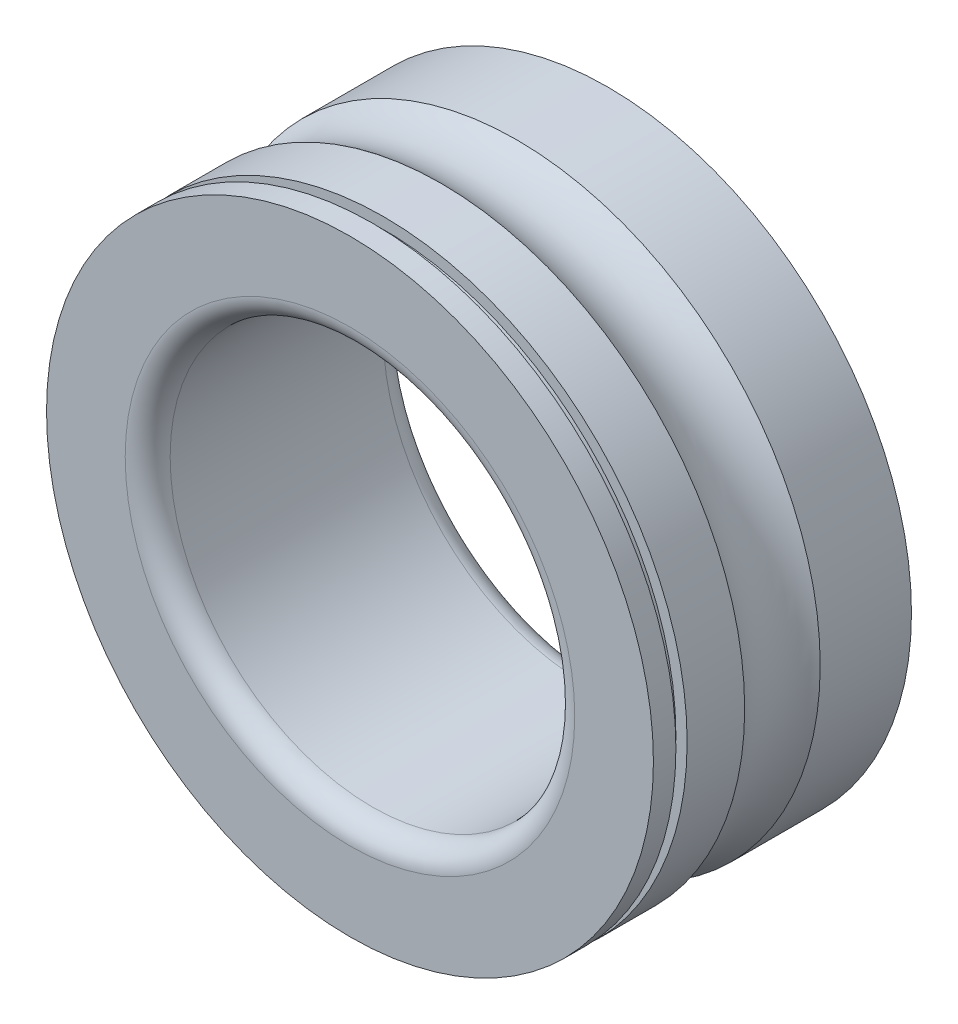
from build123d import *


with BuildPart() as part:
    # Esquisse1 → Base-R_volution (revolve)
    with BuildSketch(Plane(origin=(0, 0, 0), x_dir=(0, 0, -1), z_dir=(1, 0, 0)), mode=Mode.PRIVATE) as base_r_volution_sk:
        with BuildLine():
            Line((-2.87, 6.75), (-2.37, 6.75))
            Line((-2.37, 6.75), (-2.37, 6.5))
            Line((-2.37, 6.5), (-2.12, 6.5))
            Line((-2.12, 6.5), (-2.12, 6.75))
            Line((-2.12, 6.75), (-0.84, 6.75))
            ThreePointArc((-0.84, 6.75), (0, 6.47), (0.84, 6.75))
            Line((0.84, 6.75), (2.87, 6.75))
            Line((2.87, 6.75), (2.87, 5))
            ThreePointArc((2.87, 5), (2.723553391, 4.646446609), (2.37, 4.5))
            Line((2.37, 4.5), (-2.37, 4.5))
            ThreePointArc((-2.37, 4.5), (-2.723553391, 4.646446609), (-2.87, 5))
            Line((-2.87, 5), (-2.87, 6.75))
        make_face()
    revolve(base_r_volution_sk.sketch.rotate(Axis((0, 0, 0), (0, 0, 1)), 90), axis=Axis((0, 0, 0), (0, 0, 1)))


solid = part.part
